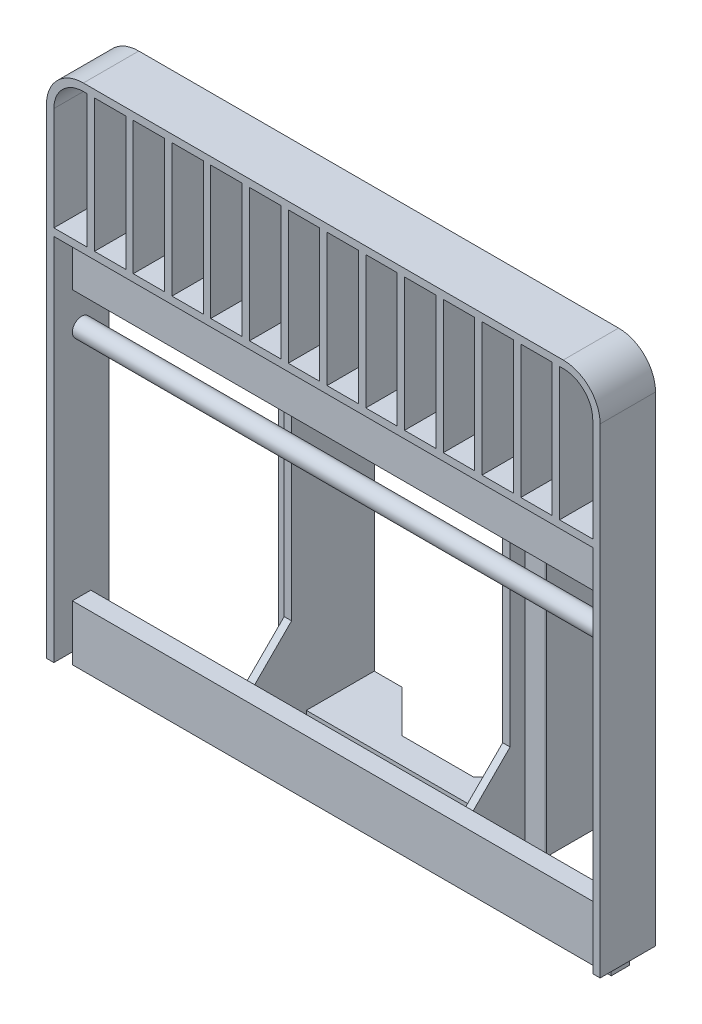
from build123d import *

# Parameters (mm, degrees)
BOSS_EXTRUDE1_DEPTH  = 150
BOSS_EXTRUDE2_DEPTH  = 150
LPATTERN1_COUNT      = 7
LPATTERN1_PITCH      = 105
LPATTERN1_COL_COUNT  = 7
LPATTERN1_COL_PITCH  = 105
SKETCH3_R            = 25
SKETCH3_W            = 50
SKETCH3_H            = 150
BOSS_EXTRUDE3_DEPTH  = 1460
BOSS_EXTRUDE10_DEPTH = 1030
CUT_EXTRUDE1_DEPTH   = 776
FILLET1_R            = 2
FILLET2_R            = 2
BOSS_EXTRUDE44_DEPTH = 20


with BuildPart() as part:
    # Sketch1 → Boss-Extrude1 (new body)
    with BuildSketch(Plane.XY):
        with BuildLine():
            Line((0, 1300), (0, 0))
            Line((0, 0), (20, 0))
            Line((20, 0), (20, 1000))
            Line((20, 1000), (1480, 1000))
            Line((1480, 1000), (1480, 0))
            Line((1480, 0), (1500, 0))
            Line((1500, 0), (1500, 1300))
            ThreePointArc((1500, 1300), (1470.710678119, 1370.710678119), (1400, 1400))
            Line((1400, 1400), (100, 1400))
            ThreePointArc((100, 1400), (29.289321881, 1370.710678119), (0, 1300))
        make_face()
        with BuildLine():
            Line((1480, 1300), (1480, 1020))
            Line((1480, 1020), (20, 1020))
            Line((20, 1020), (20, 1300))
            ThreePointArc((20, 1300), (43.431457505, 1356.568542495), (100, 1380))
            Line((100, 1380), (1400, 1380))
            ThreePointArc((1400, 1380), (1456.568542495, 1356.568542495), (1480, 1300))
        make_face(mode=Mode.SUBTRACT)
    extrude(amount=BOSS_EXTRUDE1_DEPTH)

    # Sketch2 → Boss-Extrude2 (add, through all)
    with BuildSketch(Plane.XY.offset(150)):
        Polygon((760, 1380), (740, 1380), (740, 1020), (750, 1020), (760, 1020), align=None)
    boss_extrude2 = extrude(amount=-BOSS_EXTRUDE2_DEPTH)

    # LPattern1: Boss-Extrude2 ×7
    with Locations(*[(-i * LPATTERN1_PITCH, 0, 0) for i in range(1, LPATTERN1_COUNT)]):
        add(boss_extrude2)

    # LPattern1 col: Boss-Extrude2 ×7
    with Locations(*[(i * LPATTERN1_COL_PITCH, 0, 0) for i in range(1, LPATTERN1_COL_COUNT)]):
        add(boss_extrude2)

    # Sketch3 → Boss-Extrude3 (add)
    with BuildSketch(Plane(origin=(20, 0, 0), x_dir=(0, 0, -1), z_dir=(1, 0, 0))):
        with Locations(Location((-75, 750, 0), (0, 0, 180))):
            Circle(SKETCH3_R)
        with Locations((-75, 45)):
            Rectangle(SKETCH3_W, SKETCH3_H)
        with Locations((-75, 925)):
            Rectangle(SKETCH3_W, SKETCH3_H)
    extrude(amount=BOSS_EXTRUDE3_DEPTH)


with BuildPart() as body_2:
    # Sketch5 → Boss-Extrude10 (new body)
    with BuildSketch(Plane.XZ.offset(-1000)):
        Polygon((1036, 50), (1036, -274), (1113, -274), (1113, -90), (1056, -90), (1056, 50), align=None)
    extrude(amount=BOSS_EXTRUDE10_DEPTH)


with BuildPart() as body_3:
    # Mirror25: mirrored copy
    add(body_2.part.mirror(Plane(origin=(750, 0, 0), x_dir=(0, 0, 1), z_dir=(1, 0, 0))))


with BuildPart() as cut_extrude1_tool:
    # Sketch7 → Cut-Extrude1 (new body)
    with BuildSketch(Plane(origin=(1056, 0, 0), x_dir=(0, 0, -1), z_dir=(1, 0, 0))):
        Polygon((-50, 850), (50, 750), (50, 220), (-50, 120), align=None)
    extrude(amount=-CUT_EXTRUDE1_DEPTH)


with BuildPart() as body_2_1:
    add(body_2.part)

    # Cut-Extrude1: cut by cut_extrude1_tool
    add(cut_extrude1_tool.part, mode=Mode.SUBTRACT)

    # Fillet1
    fillet1_edges = [body_2_1.edges().sort_by_distance(p)[0] for p in [
        (1113, 485, -90),
        (1113, 485, -274),
    ]]
    fillet(fillet1_edges, radius=FILLET1_R)



with BuildPart() as body_3_1:
    add(body_3.part)

    # Cut-Extrude1: cut by cut_extrude1_tool
    add(cut_extrude1_tool.part, mode=Mode.SUBTRACT)

    # Fillet2
    fillet2_edges = [body_3_1.edges().sort_by_distance(p)[0] for p in [
        (387, 485, -90),
        (387, 485, -274),
    ]]
    fillet(fillet2_edges, radius=FILLET2_R)


with BuildPart() as body_2_2:
    add(body_2_1.part)

    add(body_3_1.part)  # Boss-Extrude44 merges body 3
    # Sketch8 → Boss-Extrude44 (add)
    with BuildSketch(Plane(origin=(0, 1000, 0), x_dir=(1, 0, 0), z_dir=(0, 1, 0))):
        Polygon((464, 274), (539, 274), (653, 160), (847, 160), (961, 274), (1036, 274), (1036, 90), (464, 90), align=None)
    boss_extrude44 = extrude(amount=-BOSS_EXTRUDE44_DEPTH)

    # Mirror26: Boss-Extrude44 across plane
    add(boss_extrude44.mirror(Plane(origin=(0, 485, 0), x_dir=(0, 0, 1), z_dir=(0, -1, 0))))


solid = Compound([part.part, body_2_2.part])
